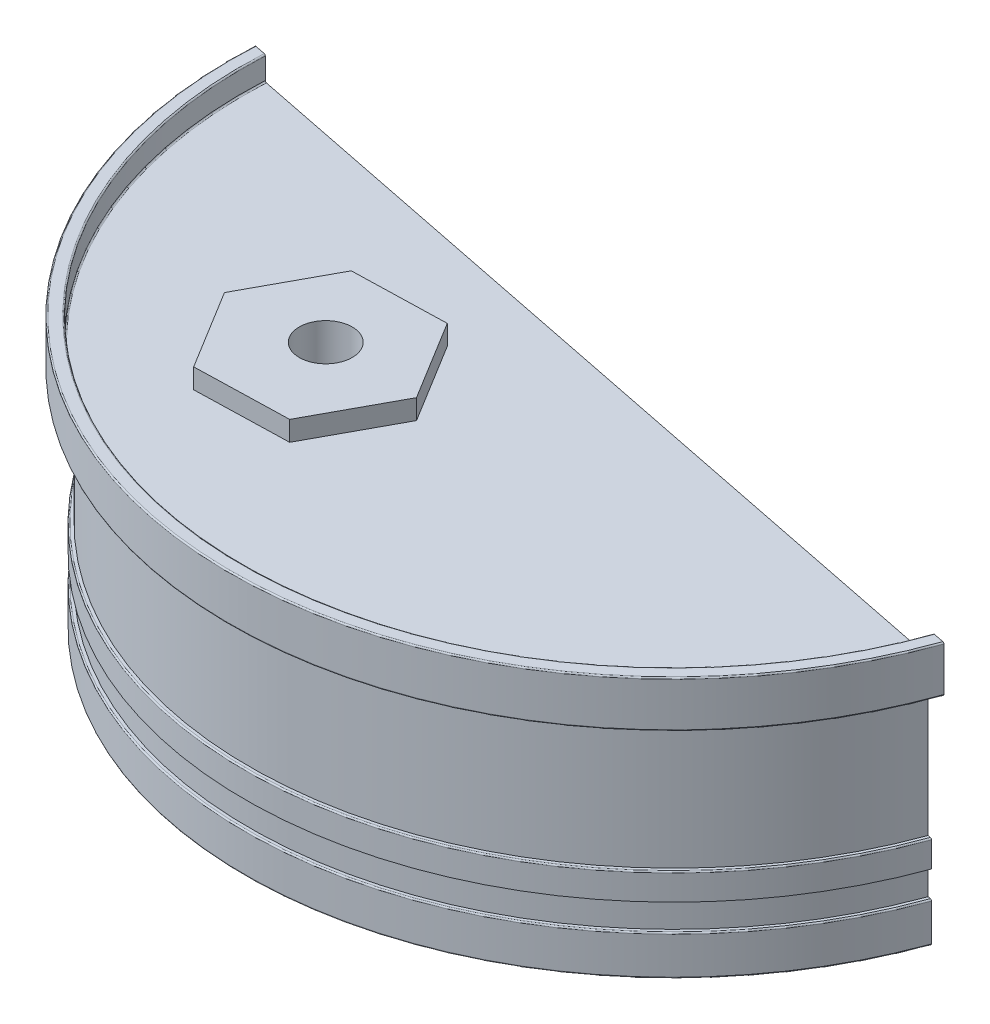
from build123d import *

# Parameters (mm, degrees)
CONG_1_R                     = 1
EXTRUSION1_DEPTH             = 15
ESQUISSE3_R                  = 20
ENL_V_MAT_EXTRU_1_DEPTH      = 30
ENL_V_MAT_EXTRU_2_DEPTH      = 510.331915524
ENL_V_MAT_EXTRU_2_DEPTH_BACK = 510.331915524


with BuildPart() as part:
    # Esquisse1 → R_volution1 (revolve)
    with BuildSketch(Plane.XY, mode=Mode.PRIVATE) as r_volution1_sk:
        Polygon((-325, 0), (-325, 18), (-335, 18), (-335, -17), (-320, -17), (-320, -117), (-323.178471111, -117), (-323.178471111, -137), (-320, -137), (-320, -157), (-323.178471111, -157), (-323.178471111, -187), (0, -187), (0, 0), align=None)
    revolve(r_volution1_sk.sketch.rotate(Axis((0, 62.544636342, 0), (0, -1, 0)), 270), axis=Axis((0, 62.544636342, 0), (0, -1, 0)))

    # Cong_1
    cong_1_edges = [part.edges().sort_by_distance(p)[0] for p in [
        (0, -117, -323.178471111),
        (0, -157, -323.178471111),
        (0, -187, -323.178471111),
        (0, 0, -325),
        (0, 18, -325),
        (0, 18, -335),
        (0, -17, -335),
        (0, -17, -320),
    ]]
    fillet(cong_1_edges, radius=CONG_1_R)

    # Esquisse2 → Extrusion1 (add)
    with BuildSketch(Plane(origin=(0, 0, 0), x_dir=(-1, 0, 0), z_dir=(0, 1, 0))):
        Polygon((79.89297215, 209.849177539), (46.262804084, 147.796115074), (83.187248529, 87.645003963), (153.741861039, 89.546955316), (187.372029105, 151.600017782), (150.447584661, 211.751128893), align=None)
    extrude(amount=EXTRUSION1_DEPTH)

    # Esquisse3 → Enl_v. mat.-Extru.1 (cut)
    with BuildSketch(Plane(origin=(0, 15, 0), x_dir=(-1, 0, 0), z_dir=(0, 1, 0))):
        with Locations(Location((116.714325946, 145.831287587, 0), (0, 0, 90))):
            Circle(ESQUISSE3_R)
    extrude(amount=-ENL_V_MAT_EXTRU_1_DEPTH, mode=Mode.SUBTRACT)

    # Esquisse4 → Enl_v. mat.-Extru.2 (cut, two sides: drawn at the far end of the back side and taken through both)
    with BuildSketch(Plane(origin=(0, 0, 0), x_dir=(-1, 0, 0), z_dir=(0, 1, 0)).offset(-ENL_V_MAT_EXTRU_2_DEPTH_BACK)):
        Polygon((-357.928888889, 120.302222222), (367.457777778, -25.013333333), (340.062222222, -475.253333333), (-357.928888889, -369.244444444), align=None)
    extrude(amount=ENL_V_MAT_EXTRU_2_DEPTH + ENL_V_MAT_EXTRU_2_DEPTH_BACK, mode=Mode.SUBTRACT)


solid = part.part
